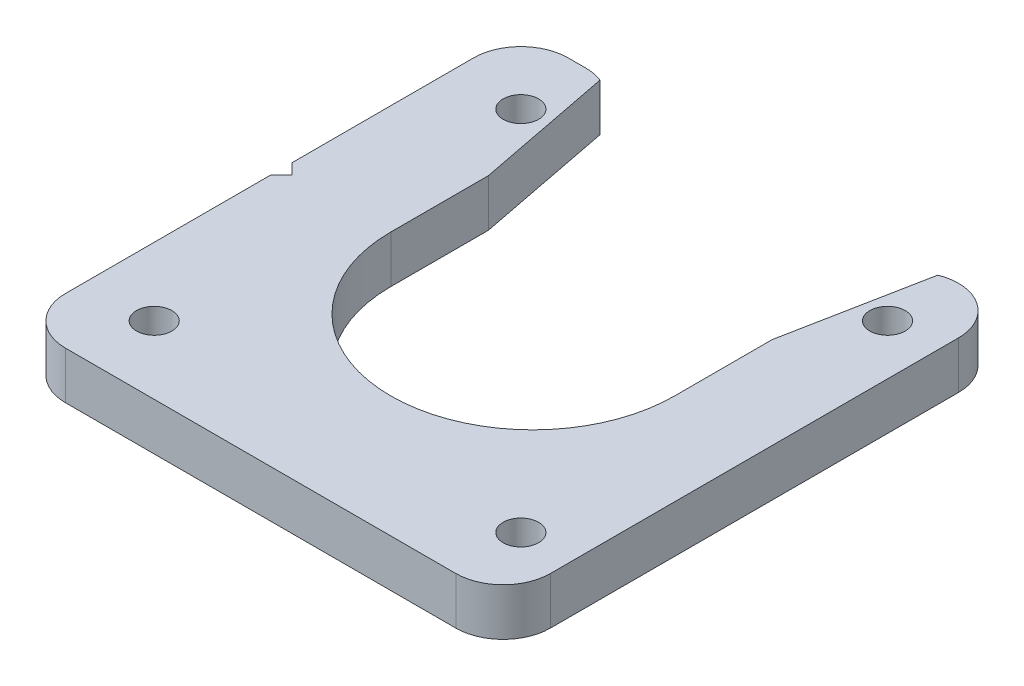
ISO-10303-21;
HEADER;
FILE_DESCRIPTION(('STEP AP214'),'2;1');
FILE_NAME('part.step','',(''),(''),'','','');
FILE_SCHEMA(('AUTOMOTIVE_DESIGN { 1 0 10303 214 1 1 1 1 }'));
ENDSEC;
DATA;
#1=APPLICATION_CONTEXT('core data for automotive mechanical design processes');
#2=APPLICATION_PROTOCOL_DEFINITION('international standard','automotive_design',2000,#1);
#3=PRODUCT_CONTEXT('',#1,'mechanical');
#4=PRODUCT('Part','Part','',(#3));
#5=PRODUCT_RELATED_PRODUCT_CATEGORY('part','',(#4));
#6=PRODUCT_DEFINITION_FORMATION('','',#4);
#7=PRODUCT_DEFINITION_CONTEXT('part definition',#1,'design');
#8=PRODUCT_DEFINITION('design','',#6,#7);
#9=PRODUCT_DEFINITION_SHAPE('','',#8);
#10=(LENGTH_UNIT() NAMED_UNIT(*) SI_UNIT(.MILLI.,.METRE.));
#11=(NAMED_UNIT(*) PLANE_ANGLE_UNIT() SI_UNIT($,.RADIAN.));
#12=(NAMED_UNIT(*) SI_UNIT($,.STERADIAN.) SOLID_ANGLE_UNIT());
#13=UNCERTAINTY_MEASURE_WITH_UNIT(LENGTH_MEASURE(1.E-05),#10,'distance_accuracy_value','');
#14=(GEOMETRIC_REPRESENTATION_CONTEXT(3) GLOBAL_UNCERTAINTY_ASSIGNED_CONTEXT((#13)) GLOBAL_UNIT_ASSIGNED_CONTEXT((#10,
#11,#12)) REPRESENTATION_CONTEXT('',''));
#15=CARTESIAN_POINT('',(0.,0.,0.));
#16=DIRECTION('',(0.,0.,1.));
#17=DIRECTION('',(1.,0.,0.));
#18=AXIS2_PLACEMENT_3D('',#15,#16,#17);
#19=CARTESIAN_POINT('',(-15.75,-2.,-20.25));
#20=DIRECTION('',(0.,0.,-1.));
#21=DIRECTION('',(-1.,0.,0.));
#22=AXIS2_PLACEMENT_3D('',#19,#20,#21);
#23=PLANE('',#22);
#24=DIRECTION('',(0.,1.,0.));
#25=VECTOR('',#24,1.);
#26=CARTESIAN_POINT('',(-15.75,-2.,-20.25));
#27=LINE('',#26,#25);
#28=CARTESIAN_POINT('',(-15.75,-2.,-20.25));
#29=VERTEX_POINT('',#28);
#30=CARTESIAN_POINT('',(-15.75,2.,-20.25));
#31=VERTEX_POINT('',#30);
#32=EDGE_CURVE('E239',#29,#31,#27,.T.);
#33=ORIENTED_EDGE('',*,*,#32,.F.);
#34=DIRECTION('',(-1.,0.,0.));
#35=VECTOR('',#34,1.);
#36=CARTESIAN_POINT('',(-15.75,-2.,-20.25));
#37=LINE('',#36,#35);
#38=CARTESIAN_POINT('',(-17.25,-2.,-20.25));
#39=VERTEX_POINT('',#38);
#40=EDGE_CURVE('E256',#29,#39,#37,.T.);
#41=ORIENTED_EDGE('',*,*,#40,.T.);
#42=DIRECTION('',(0.,1.,0.));
#43=VECTOR('',#42,1.);
#44=CARTESIAN_POINT('',(-17.25,-2.,-20.25));
#45=LINE('',#44,#43);
#46=CARTESIAN_POINT('',(-17.25,2.,-20.25));
#47=VERTEX_POINT('',#46);
#48=EDGE_CURVE('E210',#47,#39,#45,.F.);
#49=ORIENTED_EDGE('',*,*,#48,.F.);
#50=DIRECTION('',(1.,0.,0.));
#51=VECTOR('',#50,1.);
#52=CARTESIAN_POINT('',(0.,2.,-20.25));
#53=LINE('',#52,#51);
#54=EDGE_CURVE('E216',#31,#47,#53,.F.);
#55=ORIENTED_EDGE('',*,*,#54,.F.);
#56=EDGE_LOOP('',(#33,#41,#49,#55));
#57=FACE_BOUND('',#56,.T.);
#58=ADVANCED_FACE('F17',(#57),#23,.T.);
#59=CARTESIAN_POINT('',(-21.25,-2.,-0.9));
#60=DIRECTION('',(-0.707106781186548,0.,0.707106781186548));
#61=DIRECTION('',(0.707106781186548,0.,0.707106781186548));
#62=AXIS2_PLACEMENT_3D('',#59,#60,#61);
#63=PLANE('',#62);
#64=DIRECTION('',(0.,1.,0.));
#65=VECTOR('',#64,1.);
#66=CARTESIAN_POINT('',(-21.25,-2.,-0.9));
#67=LINE('',#66,#65);
#68=CARTESIAN_POINT('',(-21.25,-2.,-0.9));
#69=VERTEX_POINT('',#68);
#70=CARTESIAN_POINT('',(-21.25,2.,-0.9));
#71=VERTEX_POINT('',#70);
#72=EDGE_CURVE('E208',#69,#71,#67,.T.);
#73=ORIENTED_EDGE('',*,*,#72,.F.);
#74=DIRECTION('',(0.707106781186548,0.,0.707106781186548));
#75=VECTOR('',#74,1.);
#76=CARTESIAN_POINT('',(-21.25,-2.,-0.9));
#77=LINE('',#76,#75);
#78=CARTESIAN_POINT('',(-20.35,-2.,0.));
#79=VERTEX_POINT('',#78);
#80=EDGE_CURVE('E254',#69,#79,#77,.T.);
#81=ORIENTED_EDGE('',*,*,#80,.T.);
#82=DIRECTION('',(0.,1.,0.));
#83=VECTOR('',#82,1.);
#84=CARTESIAN_POINT('',(-20.35,-2.,0.));
#85=LINE('',#84,#83);
#86=CARTESIAN_POINT('',(-20.35,2.,0.));
#87=VERTEX_POINT('',#86);
#88=EDGE_CURVE('E240',#87,#79,#85,.F.);
#89=ORIENTED_EDGE('',*,*,#88,.F.);
#90=DIRECTION('',(0.707106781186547,0.,0.707106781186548));
#91=VECTOR('',#90,1.);
#92=CARTESIAN_POINT('',(-21.25,2.,-0.9));
#93=LINE('',#92,#91);
#94=EDGE_CURVE('E245',#71,#87,#93,.T.);
#95=ORIENTED_EDGE('',*,*,#94,.F.);
#96=EDGE_LOOP('',(#73,#81,#89,#95));
#97=FACE_BOUND('',#96,.T.);
#98=ADVANCED_FACE('F404',(#97),#63,.T.);
#99=CARTESIAN_POINT('',(-20.35,-2.,0.));
#100=DIRECTION('',(-0.707106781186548,0.,-0.707106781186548));
#101=DIRECTION('',(-0.707106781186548,0.,0.707106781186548));
#102=AXIS2_PLACEMENT_3D('',#99,#100,#101);
#103=PLANE('',#102);
#104=ORIENTED_EDGE('',*,*,#88,.T.);
#105=DIRECTION('',(-0.707106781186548,0.,0.707106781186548));
#106=VECTOR('',#105,1.);
#107=CARTESIAN_POINT('',(-20.35,-2.,0.));
#108=LINE('',#107,#106);
#109=CARTESIAN_POINT('',(-21.25,-2.,0.9));
#110=VERTEX_POINT('',#109);
#111=EDGE_CURVE('E237',#79,#110,#108,.T.);
#112=ORIENTED_EDGE('',*,*,#111,.T.);
#113=DIRECTION('',(0.,1.,0.));
#114=VECTOR('',#113,1.);
#115=CARTESIAN_POINT('',(-21.25,-2.,0.9));
#116=LINE('',#115,#114);
#117=CARTESIAN_POINT('',(-21.25,2.,0.9));
#118=VERTEX_POINT('',#117);
#119=EDGE_CURVE('E199',#118,#110,#116,.F.);
#120=ORIENTED_EDGE('',*,*,#119,.F.);
#121=DIRECTION('',(-0.707106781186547,0.,0.707106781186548));
#122=VECTOR('',#121,1.);
#123=CARTESIAN_POINT('',(-20.35,2.,0.));
#124=LINE('',#123,#122);
#125=EDGE_CURVE('E243',#87,#118,#124,.T.);
#126=ORIENTED_EDGE('',*,*,#125,.F.);
#127=EDGE_LOOP('',(#104,#112,#120,#126));
#128=FACE_BOUND('',#127,.T.);
#129=ADVANCED_FACE('F400',(#128),#103,.T.);
#130=CARTESIAN_POINT('',(-15.75,-2.,-16.25));
#131=DIRECTION('',(0.,1.,0.));
#132=DIRECTION('',(0.,0.,1.));
#133=AXIS2_PLACEMENT_3D('',#130,#131,#132);
#134=CYLINDRICAL_SURFACE('',#133,4.);
#135=DIRECTION('',(0.,1.,0.));
#136=VECTOR('',#135,1.);
#137=CARTESIAN_POINT('',(-14.2780019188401,-2.,-19.96930391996));
#138=LINE('',#137,#136);
#139=CARTESIAN_POINT('',(-14.2780019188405,-2.,-19.9693039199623));
#140=VERTEX_POINT('',#139);
#141=CARTESIAN_POINT('',(-14.2780019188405,2.,-19.9693039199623));
#142=VERTEX_POINT('',#141);
#143=EDGE_CURVE('E142',#140,#142,#138,.T.);
#144=ORIENTED_EDGE('',*,*,#143,.F.);
#145=CARTESIAN_POINT('',(-15.75,-2.,-16.25));
#146=DIRECTION('',(0.,1.,0.));
#147=DIRECTION('',(0.,0.,1.));
#148=AXIS2_PLACEMENT_3D('',#145,#146,#147);
#149=CIRCLE('',#148,4.);
#150=EDGE_CURVE('E20',#140,#29,#149,.T.);
#151=ORIENTED_EDGE('',*,*,#150,.T.);
#152=ORIENTED_EDGE('',*,*,#32,.T.);
#153=CARTESIAN_POINT('',(-15.75,2.,-16.25));
#154=DIRECTION('',(0.,1.,0.));
#155=DIRECTION('',(0.,0.,1.));
#156=AXIS2_PLACEMENT_3D('',#153,#154,#155);
#157=CIRCLE('',#156,4.);
#158=EDGE_CURVE('E217',#142,#31,#157,.T.);
#159=ORIENTED_EDGE('',*,*,#158,.F.);
#160=EDGE_LOOP('',(#144,#151,#152,#159));
#161=FACE_BOUND('',#160,.T.);
#162=ADVANCED_FACE('F537',(#161),#134,.T.);
#163=CARTESIAN_POINT('',(0.,2.,0.));
#164=DIRECTION('',(0.,1.,0.));
#165=DIRECTION('',(0.,0.,1.));
#166=AXIS2_PLACEMENT_3D('',#163,#164,#165);
#167=PLANE('',#166);
#168=CARTESIAN_POINT('',(-15.5,2.,-14.5));
#169=DIRECTION('',(0.,1.,0.));
#170=DIRECTION('',(0.,0.,1.));
#171=AXIS2_PLACEMENT_3D('',#168,#169,#170);
#172=CIRCLE('',#171,1.5);
#173=CARTESIAN_POINT('',(-15.5,2.,-13.));
#174=VERTEX_POINT('',#173);
#175=EDGE_CURVE('E298',#174,#174,#172,.F.);
#176=ORIENTED_EDGE('',*,*,#175,.T.);
#177=EDGE_LOOP('',(#176));
#178=FACE_BOUND('',#177,.T.);
#179=CARTESIAN_POINT('',(-15.5,2.,16.5));
#180=DIRECTION('',(0.,1.,0.));
#181=DIRECTION('',(0.,0.,1.));
#182=AXIS2_PLACEMENT_3D('',#179,#180,#181);
#183=CIRCLE('',#182,1.5);
#184=CARTESIAN_POINT('',(-15.5,2.,18.));
#185=VERTEX_POINT('',#184);
#186=EDGE_CURVE('E301',#185,#185,#183,.F.);
#187=ORIENTED_EDGE('',*,*,#186,.T.);
#188=EDGE_LOOP('',(#187));
#189=FACE_BOUND('',#188,.T.);
#190=CARTESIAN_POINT('',(15.5,2.,16.5));
#191=DIRECTION('',(0.,1.,0.));
#192=DIRECTION('',(0.,0.,1.));
#193=AXIS2_PLACEMENT_3D('',#190,#191,#192);
#194=CIRCLE('',#193,1.5);
#195=CARTESIAN_POINT('',(15.5,2.,18.));
#196=VERTEX_POINT('',#195);
#197=EDGE_CURVE('E163',#196,#196,#194,.F.);
#198=ORIENTED_EDGE('',*,*,#197,.T.);
#199=EDGE_LOOP('',(#198));
#200=FACE_BOUND('',#199,.T.);
#201=CARTESIAN_POINT('',(15.5,2.,-14.5));
#202=DIRECTION('',(0.,1.,0.));
#203=DIRECTION('',(0.,0.,1.));
#204=AXIS2_PLACEMENT_3D('',#201,#202,#203);
#205=CIRCLE('',#204,1.5);
#206=CARTESIAN_POINT('',(15.5,2.,-13.));
#207=VERTEX_POINT('',#206);
#208=EDGE_CURVE('E160',#207,#207,#205,.F.);
#209=ORIENTED_EDGE('',*,*,#208,.T.);
#210=EDGE_LOOP('',(#209));
#211=FACE_BOUND('',#210,.T.);
#212=ORIENTED_EDGE('',*,*,#54,.T.);
#213=CARTESIAN_POINT('',(-17.25,2.,-16.25));
#214=DIRECTION('',(0.,1.,0.));
#215=DIRECTION('',(0.,0.,1.));
#216=AXIS2_PLACEMENT_3D('',#213,#214,#215);
#217=CIRCLE('',#216,4.);
#218=CARTESIAN_POINT('',(-21.25,2.,-16.25));
#219=VERTEX_POINT('',#218);
#220=EDGE_CURVE('E215',#219,#47,#217,.F.);
#221=ORIENTED_EDGE('',*,*,#220,.F.);
#222=DIRECTION('',(0.,0.,1.));
#223=VECTOR('',#222,1.);
#224=CARTESIAN_POINT('',(-21.25,2.,-16.25));
#225=LINE('',#224,#223);
#226=EDGE_CURVE('E207',#71,#219,#225,.F.);
#227=ORIENTED_EDGE('',*,*,#226,.F.);
#228=ORIENTED_EDGE('',*,*,#94,.T.);
#229=ORIENTED_EDGE('',*,*,#125,.T.);
#230=DIRECTION('',(0.,0.,1.));
#231=VECTOR('',#230,1.);
#232=CARTESIAN_POINT('',(-21.25,2.,0.9));
#233=LINE('',#232,#231);
#234=CARTESIAN_POINT('',(-21.25,2.,18.25));
#235=VERTEX_POINT('',#234);
#236=EDGE_CURVE('E202',#235,#118,#233,.F.);
#237=ORIENTED_EDGE('',*,*,#236,.F.);
#238=CARTESIAN_POINT('',(-17.25,2.,18.25));
#239=DIRECTION('',(0.,1.,0.));
#240=DIRECTION('',(0.,0.,1.));
#241=AXIS2_PLACEMENT_3D('',#238,#239,#240);
#242=CIRCLE('',#241,4.);
#243=CARTESIAN_POINT('',(-17.25,2.,22.25));
#244=VERTEX_POINT('',#243);
#245=EDGE_CURVE('E198',#244,#235,#242,.F.);
#246=ORIENTED_EDGE('',*,*,#245,.F.);
#247=DIRECTION('',(1.,0.,0.));
#248=VECTOR('',#247,1.);
#249=CARTESIAN_POINT('',(-17.25,2.,22.25));
#250=LINE('',#249,#248);
#251=CARTESIAN_POINT('',(15.75,2.,22.25));
#252=VERTEX_POINT('',#251);
#253=EDGE_CURVE('E195',#252,#244,#250,.F.);
#254=ORIENTED_EDGE('',*,*,#253,.F.);
#255=CARTESIAN_POINT('',(15.75,2.,18.25));
#256=DIRECTION('',(0.,1.,0.));
#257=DIRECTION('',(0.,0.,1.));
#258=AXIS2_PLACEMENT_3D('',#255,#256,#257);
#259=CIRCLE('',#258,4.);
#260=CARTESIAN_POINT('',(19.75,2.,18.25));
#261=VERTEX_POINT('',#260);
#262=EDGE_CURVE('E192',#261,#252,#259,.F.);
#263=ORIENTED_EDGE('',*,*,#262,.F.);
#264=DIRECTION('',(0.,0.,-1.));
#265=VECTOR('',#264,1.);
#266=CARTESIAN_POINT('',(19.75,2.,18.25));
#267=LINE('',#266,#265);
#268=CARTESIAN_POINT('',(19.75,2.,-16.25));
#269=VERTEX_POINT('',#268);
#270=EDGE_CURVE('E188',#269,#261,#267,.F.);
#271=ORIENTED_EDGE('',*,*,#270,.F.);
#272=CARTESIAN_POINT('',(15.75,2.,-16.25));
#273=DIRECTION('',(0.,1.,0.));
#274=DIRECTION('',(0.,0.,1.));
#275=AXIS2_PLACEMENT_3D('',#272,#273,#274);
#276=CIRCLE('',#275,4.);
#277=CARTESIAN_POINT('',(14.2780019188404,2.,-19.9693039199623));
#278=VERTEX_POINT('',#277);
#279=EDGE_CURVE('E184',#278,#269,#276,.F.);
#280=ORIENTED_EDGE('',*,*,#279,.F.);
#281=DIRECTION('',(-0.190808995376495,0.,0.981627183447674));
#282=VECTOR('',#281,1.);
#283=CARTESIAN_POINT('',(14.27800191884,2.,-19.96930391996));
#284=LINE('',#283,#282);
#285=CARTESIAN_POINT('',(12.,2.,-8.25000000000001));
#286=VERTEX_POINT('',#285);
#287=EDGE_CURVE('E181',#286,#278,#284,.F.);
#288=ORIENTED_EDGE('',*,*,#287,.F.);
#289=DIRECTION('',(0.,0.,1.));
#290=VECTOR('',#289,1.);
#291=CARTESIAN_POINT('',(12.,2.,-8.25));
#292=LINE('',#291,#290);
#293=CARTESIAN_POINT('',(12.,2.,0.));
#294=VERTEX_POINT('',#293);
#295=EDGE_CURVE('E176',#294,#286,#292,.F.);
#296=ORIENTED_EDGE('',*,*,#295,.F.);
#297=CARTESIAN_POINT('',(0.,2.,0.));
#298=DIRECTION('',(0.,1.,0.));
#299=DIRECTION('',(0.,0.,1.));
#300=AXIS2_PLACEMENT_3D('',#297,#298,#299);
#301=CIRCLE('',#300,12.);
#302=CARTESIAN_POINT('',(-12.,2.,0.));
#303=VERTEX_POINT('',#302);
#304=EDGE_CURVE('E151',#294,#303,#301,.F.);
#305=ORIENTED_EDGE('',*,*,#304,.T.);
#306=DIRECTION('',(0.,0.,-1.));
#307=VECTOR('',#306,1.);
#308=CARTESIAN_POINT('',(-12.,2.,0.));
#309=LINE('',#308,#307);
#310=CARTESIAN_POINT('',(-12.,2.,-8.25));
#311=VERTEX_POINT('',#310);
#312=EDGE_CURVE('E148',#311,#303,#309,.F.);
#313=ORIENTED_EDGE('',*,*,#312,.F.);
#314=DIRECTION('',(-0.190808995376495,0.,-0.981627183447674));
#315=VECTOR('',#314,1.);
#316=CARTESIAN_POINT('',(-12.,2.,-8.25));
#317=LINE('',#316,#315);
#318=EDGE_CURVE('E136',#142,#311,#317,.F.);
#319=ORIENTED_EDGE('',*,*,#318,.F.);
#320=ORIENTED_EDGE('',*,*,#158,.T.);
#321=EDGE_LOOP('',(#212,#221,#227,#228,#229,#237,#246,#254,#263,#271,#280,#288,#296,#305,#313,
#319,#320));
#322=FACE_BOUND('',#321,.T.);
#323=ADVANCED_FACE('F149',(#178,#189,#200,#211,#322),#167,.T.);
#324=CARTESIAN_POINT('',(-17.25,-2.,-16.25));
#325=DIRECTION('',(0.,1.,0.));
#326=DIRECTION('',(0.,0.,1.));
#327=AXIS2_PLACEMENT_3D('',#324,#325,#326);
#328=CYLINDRICAL_SURFACE('',#327,4.);
#329=ORIENTED_EDGE('',*,*,#48,.T.);
#330=CARTESIAN_POINT('',(-17.25,-2.,-16.25));
#331=DIRECTION('',(0.,1.,0.));
#332=DIRECTION('',(0.,0.,1.));
#333=AXIS2_PLACEMENT_3D('',#330,#331,#332);
#334=CIRCLE('',#333,4.);
#335=CARTESIAN_POINT('',(-21.25,-2.,-16.25));
#336=VERTEX_POINT('',#335);
#337=EDGE_CURVE('E294',#39,#336,#334,.T.);
#338=ORIENTED_EDGE('',*,*,#337,.T.);
#339=DIRECTION('',(0.,1.,0.));
#340=VECTOR('',#339,1.);
#341=CARTESIAN_POINT('',(-21.25,-2.,-16.25));
#342=LINE('',#341,#340);
#343=EDGE_CURVE('E205',#219,#336,#342,.F.);
#344=ORIENTED_EDGE('',*,*,#343,.F.);
#345=ORIENTED_EDGE('',*,*,#220,.T.);
#346=EDGE_LOOP('',(#329,#338,#344,#345));
#347=FACE_BOUND('',#346,.T.);
#348=ADVANCED_FACE('F322',(#347),#328,.T.);
#349=CARTESIAN_POINT('',(-21.25,-2.,-16.25));
#350=DIRECTION('',(-1.,0.,0.));
#351=DIRECTION('',(0.,0.,1.));
#352=AXIS2_PLACEMENT_3D('',#349,#350,#351);
#353=PLANE('',#352);
#354=ORIENTED_EDGE('',*,*,#343,.T.);
#355=DIRECTION('',(0.,0.,1.));
#356=VECTOR('',#355,1.);
#357=CARTESIAN_POINT('',(-21.25,-2.,0.));
#358=LINE('',#357,#356);
#359=EDGE_CURVE('E297',#336,#69,#358,.T.);
#360=ORIENTED_EDGE('',*,*,#359,.T.);
#361=ORIENTED_EDGE('',*,*,#72,.T.);
#362=ORIENTED_EDGE('',*,*,#226,.T.);
#363=EDGE_LOOP('',(#354,#360,#361,#362));
#364=FACE_BOUND('',#363,.T.);
#365=ADVANCED_FACE('F406',(#364),#353,.T.);
#366=CARTESIAN_POINT('',(-21.25,-2.,0.9));
#367=DIRECTION('',(-1.,0.,0.));
#368=DIRECTION('',(0.,0.,1.));
#369=AXIS2_PLACEMENT_3D('',#366,#367,#368);
#370=PLANE('',#369);
#371=ORIENTED_EDGE('',*,*,#119,.T.);
#372=DIRECTION('',(0.,0.,1.));
#373=VECTOR('',#372,1.);
#374=CARTESIAN_POINT('',(-21.25,-2.,0.));
#375=LINE('',#374,#373);
#376=CARTESIAN_POINT('',(-21.25,-2.,18.25));
#377=VERTEX_POINT('',#376);
#378=EDGE_CURVE('E293',#110,#377,#375,.T.);
#379=ORIENTED_EDGE('',*,*,#378,.T.);
#380=DIRECTION('',(0.,1.,0.));
#381=VECTOR('',#380,1.);
#382=CARTESIAN_POINT('',(-21.25,-2.,18.25));
#383=LINE('',#382,#381);
#384=EDGE_CURVE('E196',#235,#377,#383,.F.);
#385=ORIENTED_EDGE('',*,*,#384,.F.);
#386=ORIENTED_EDGE('',*,*,#236,.T.);
#387=EDGE_LOOP('',(#371,#379,#385,#386));
#388=FACE_BOUND('',#387,.T.);
#389=ADVANCED_FACE('F396',(#388),#370,.T.);
#390=CARTESIAN_POINT('',(-17.25,-2.,18.25));
#391=DIRECTION('',(0.,1.,0.));
#392=DIRECTION('',(0.,0.,1.));
#393=AXIS2_PLACEMENT_3D('',#390,#391,#392);
#394=CYLINDRICAL_SURFACE('',#393,4.);
#395=ORIENTED_EDGE('',*,*,#384,.T.);
#396=CARTESIAN_POINT('',(-17.25,-2.,18.25));
#397=DIRECTION('',(0.,1.,0.));
#398=DIRECTION('',(0.,0.,1.));
#399=AXIS2_PLACEMENT_3D('',#396,#397,#398);
#400=CIRCLE('',#399,4.);
#401=CARTESIAN_POINT('',(-17.25,-2.,22.25));
#402=VERTEX_POINT('',#401);
#403=EDGE_CURVE('E290',#377,#402,#400,.T.);
#404=ORIENTED_EDGE('',*,*,#403,.T.);
#405=DIRECTION('',(0.,1.,0.));
#406=VECTOR('',#405,1.);
#407=CARTESIAN_POINT('',(-17.25,-2.,22.25));
#408=LINE('',#407,#406);
#409=EDGE_CURVE('E193',#244,#402,#408,.F.);
#410=ORIENTED_EDGE('',*,*,#409,.F.);
#411=ORIENTED_EDGE('',*,*,#245,.T.);
#412=EDGE_LOOP('',(#395,#404,#410,#411));
#413=FACE_BOUND('',#412,.T.);
#414=ADVANCED_FACE('F391',(#413),#394,.T.);
#415=CARTESIAN_POINT('',(-17.25,-2.,22.25));
#416=DIRECTION('',(0.,0.,1.));
#417=DIRECTION('',(1.,0.,0.));
#418=AXIS2_PLACEMENT_3D('',#415,#416,#417);
#419=PLANE('',#418);
#420=ORIENTED_EDGE('',*,*,#409,.T.);
#421=DIRECTION('',(1.,0.,0.));
#422=VECTOR('',#421,1.);
#423=CARTESIAN_POINT('',(0.,-2.,22.25));
#424=LINE('',#423,#422);
#425=CARTESIAN_POINT('',(15.75,-2.,22.25));
#426=VERTEX_POINT('',#425);
#427=EDGE_CURVE('E289',#402,#426,#424,.T.);
#428=ORIENTED_EDGE('',*,*,#427,.T.);
#429=DIRECTION('',(0.,1.,0.));
#430=VECTOR('',#429,1.);
#431=CARTESIAN_POINT('',(15.75,-2.,22.25));
#432=LINE('',#431,#430);
#433=EDGE_CURVE('E189',#252,#426,#432,.F.);
#434=ORIENTED_EDGE('',*,*,#433,.F.);
#435=ORIENTED_EDGE('',*,*,#253,.T.);
#436=EDGE_LOOP('',(#420,#428,#434,#435));
#437=FACE_BOUND('',#436,.T.);
#438=ADVANCED_FACE('F387',(#437),#419,.T.);
#439=CARTESIAN_POINT('',(15.75,-2.,18.25));
#440=DIRECTION('',(0.,1.,0.));
#441=DIRECTION('',(0.,0.,1.));
#442=AXIS2_PLACEMENT_3D('',#439,#440,#441);
#443=CYLINDRICAL_SURFACE('',#442,4.);
#444=ORIENTED_EDGE('',*,*,#433,.T.);
#445=CARTESIAN_POINT('',(15.75,-2.,18.25));
#446=DIRECTION('',(0.,1.,0.));
#447=DIRECTION('',(0.,0.,1.));
#448=AXIS2_PLACEMENT_3D('',#445,#446,#447);
#449=CIRCLE('',#448,4.);
#450=CARTESIAN_POINT('',(19.75,-2.,18.25));
#451=VERTEX_POINT('',#450);
#452=EDGE_CURVE('E285',#426,#451,#449,.T.);
#453=ORIENTED_EDGE('',*,*,#452,.T.);
#454=DIRECTION('',(0.,1.,0.));
#455=VECTOR('',#454,1.);
#456=CARTESIAN_POINT('',(19.75,-2.,18.25));
#457=LINE('',#456,#455);
#458=EDGE_CURVE('E185',#261,#451,#457,.F.);
#459=ORIENTED_EDGE('',*,*,#458,.F.);
#460=ORIENTED_EDGE('',*,*,#262,.T.);
#461=EDGE_LOOP('',(#444,#453,#459,#460));
#462=FACE_BOUND('',#461,.T.);
#463=ADVANCED_FACE('F381',(#462),#443,.T.);
#464=CARTESIAN_POINT('',(19.75,-2.,18.25));
#465=DIRECTION('',(1.,0.,0.));
#466=DIRECTION('',(0.,0.,-1.));
#467=AXIS2_PLACEMENT_3D('',#464,#465,#466);
#468=PLANE('',#467);
#469=ORIENTED_EDGE('',*,*,#458,.T.);
#470=DIRECTION('',(0.,0.,1.));
#471=VECTOR('',#470,1.);
#472=CARTESIAN_POINT('',(19.75,-2.,0.));
#473=LINE('',#472,#471);
#474=CARTESIAN_POINT('',(19.75,-2.,-16.25));
#475=VERTEX_POINT('',#474);
#476=EDGE_CURVE('E284',#451,#475,#473,.F.);
#477=ORIENTED_EDGE('',*,*,#476,.T.);
#478=DIRECTION('',(0.,1.,0.));
#479=VECTOR('',#478,1.);
#480=CARTESIAN_POINT('',(19.75,-2.,-16.25));
#481=LINE('',#480,#479);
#482=EDGE_CURVE('E182',#269,#475,#481,.F.);
#483=ORIENTED_EDGE('',*,*,#482,.F.);
#484=ORIENTED_EDGE('',*,*,#270,.T.);
#485=EDGE_LOOP('',(#469,#477,#483,#484));
#486=FACE_BOUND('',#485,.T.);
#487=ADVANCED_FACE('F377',(#486),#468,.T.);
#488=CARTESIAN_POINT('',(15.75,-2.,-16.25));
#489=DIRECTION('',(0.,1.,0.));
#490=DIRECTION('',(0.,0.,1.));
#491=AXIS2_PLACEMENT_3D('',#488,#489,#490);
#492=CYLINDRICAL_SURFACE('',#491,4.);
#493=ORIENTED_EDGE('',*,*,#482,.T.);
#494=CARTESIAN_POINT('',(15.75,-2.,-16.25));
#495=DIRECTION('',(0.,1.,0.));
#496=DIRECTION('',(0.,0.,1.));
#497=AXIS2_PLACEMENT_3D('',#494,#495,#496);
#498=CIRCLE('',#497,4.);
#499=CARTESIAN_POINT('',(14.2780019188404,-2.,-19.9693039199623));
#500=VERTEX_POINT('',#499);
#501=EDGE_CURVE('E280',#475,#500,#498,.T.);
#502=ORIENTED_EDGE('',*,*,#501,.T.);
#503=DIRECTION('',(0.,1.,0.));
#504=VECTOR('',#503,1.);
#505=CARTESIAN_POINT('',(14.27800191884,-2.,-19.96930391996));
#506=LINE('',#505,#504);
#507=EDGE_CURVE('E179',#278,#500,#506,.F.);
#508=ORIENTED_EDGE('',*,*,#507,.F.);
#509=ORIENTED_EDGE('',*,*,#279,.T.);
#510=EDGE_LOOP('',(#493,#502,#508,#509));
#511=FACE_BOUND('',#510,.T.);
#512=ADVANCED_FACE('F371',(#511),#492,.T.);
#513=CARTESIAN_POINT('',(14.27800191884,-2.,-19.96930391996));
#514=DIRECTION('',(-0.981627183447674,0.,-0.190808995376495));
#515=DIRECTION('',(-0.190808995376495,0.,0.981627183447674));
#516=AXIS2_PLACEMENT_3D('',#513,#514,#515);
#517=PLANE('',#516);
#518=ORIENTED_EDGE('',*,*,#507,.T.);
#519=DIRECTION('',(-0.190808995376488,0.,0.981627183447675));
#520=VECTOR('',#519,1.);
#521=CARTESIAN_POINT('',(14.27800191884,-2.,-19.96930391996));
#522=LINE('',#521,#520);
#523=CARTESIAN_POINT('',(12.,-2.,-8.25000000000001));
#524=VERTEX_POINT('',#523);
#525=EDGE_CURVE('E283',#500,#524,#522,.T.);
#526=ORIENTED_EDGE('',*,*,#525,.T.);
#527=DIRECTION('',(0.,1.,0.));
#528=VECTOR('',#527,1.);
#529=CARTESIAN_POINT('',(12.,-2.,-8.25));
#530=LINE('',#529,#528);
#531=EDGE_CURVE('E174',#286,#524,#530,.F.);
#532=ORIENTED_EDGE('',*,*,#531,.F.);
#533=ORIENTED_EDGE('',*,*,#287,.T.);
#534=EDGE_LOOP('',(#518,#526,#532,#533));
#535=FACE_BOUND('',#534,.T.);
#536=ADVANCED_FACE('F367',(#535),#517,.T.);
#537=CARTESIAN_POINT('',(12.,-2.,-8.25));
#538=DIRECTION('',(-1.,0.,0.));
#539=DIRECTION('',(0.,0.,1.));
#540=AXIS2_PLACEMENT_3D('',#537,#538,#539);
#541=PLANE('',#540);
#542=ORIENTED_EDGE('',*,*,#531,.T.);
#543=DIRECTION('',(0.,0.,1.));
#544=VECTOR('',#543,1.);
#545=CARTESIAN_POINT('',(12.,-2.,0.));
#546=LINE('',#545,#544);
#547=CARTESIAN_POINT('',(12.,-2.,0.));
#548=VERTEX_POINT('',#547);
#549=EDGE_CURVE('E279',#524,#548,#546,.T.);
#550=ORIENTED_EDGE('',*,*,#549,.T.);
#551=DIRECTION('',(0.,1.,0.));
#552=VECTOR('',#551,1.);
#553=CARTESIAN_POINT('',(12.,-2.,0.));
#554=LINE('',#553,#552);
#555=EDGE_CURVE('E171',#548,#294,#554,.T.);
#556=ORIENTED_EDGE('',*,*,#555,.T.);
#557=ORIENTED_EDGE('',*,*,#295,.T.);
#558=EDGE_LOOP('',(#542,#550,#556,#557));
#559=FACE_BOUND('',#558,.T.);
#560=ADVANCED_FACE('F361',(#559),#541,.T.);
#561=CARTESIAN_POINT('',(0.,-2.,0.));
#562=DIRECTION('',(0.,1.,0.));
#563=DIRECTION('',(0.,0.,1.));
#564=AXIS2_PLACEMENT_3D('',#561,#562,#563);
#565=CYLINDRICAL_SURFACE('',#564,12.);
#566=ORIENTED_EDGE('',*,*,#304,.F.);
#567=ORIENTED_EDGE('',*,*,#555,.F.);
#568=CARTESIAN_POINT('',(0.,-2.,0.));
#569=DIRECTION('',(0.,1.,0.));
#570=DIRECTION('',(0.,0.,1.));
#571=AXIS2_PLACEMENT_3D('',#568,#569,#570);
#572=CIRCLE('',#571,12.);
#573=CARTESIAN_POINT('',(-12.,-2.,0.));
#574=VERTEX_POINT('',#573);
#575=EDGE_CURVE('E275',#548,#574,#572,.F.);
#576=ORIENTED_EDGE('',*,*,#575,.T.);
#577=DIRECTION('',(0.,1.,0.));
#578=VECTOR('',#577,1.);
#579=CARTESIAN_POINT('',(-12.,-2.,0.));
#580=LINE('',#579,#578);
#581=EDGE_CURVE('E154',#303,#574,#580,.F.);
#582=ORIENTED_EDGE('',*,*,#581,.F.);
#583=EDGE_LOOP('',(#566,#567,#576,#582));
#584=FACE_BOUND('',#583,.T.);
#585=ADVANCED_FACE('F359',(#584),#565,.F.);
#586=CARTESIAN_POINT('',(-12.,-2.,0.));
#587=DIRECTION('',(1.,0.,0.));
#588=DIRECTION('',(0.,0.,-1.));
#589=AXIS2_PLACEMENT_3D('',#586,#587,#588);
#590=PLANE('',#589);
#591=ORIENTED_EDGE('',*,*,#581,.T.);
#592=DIRECTION('',(0.,0.,1.));
#593=VECTOR('',#592,1.);
#594=CARTESIAN_POINT('',(-12.,-2.,0.));
#595=LINE('',#594,#593);
#596=CARTESIAN_POINT('',(-12.,-2.,-8.24999999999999));
#597=VERTEX_POINT('',#596);
#598=EDGE_CURVE('E159',#574,#597,#595,.F.);
#599=ORIENTED_EDGE('',*,*,#598,.T.);
#600=DIRECTION('',(0.,1.,0.));
#601=VECTOR('',#600,1.);
#602=CARTESIAN_POINT('',(-12.,-2.,-8.25));
#603=LINE('',#602,#601);
#604=EDGE_CURVE('E141',#311,#597,#603,.F.);
#605=ORIENTED_EDGE('',*,*,#604,.F.);
#606=ORIENTED_EDGE('',*,*,#312,.T.);
#607=EDGE_LOOP('',(#591,#599,#605,#606));
#608=FACE_BOUND('',#607,.T.);
#609=ADVANCED_FACE('F157',(#608),#590,.T.);
#610=CARTESIAN_POINT('',(-12.,-2.,-8.25));
#611=DIRECTION('',(0.981627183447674,0.,-0.190808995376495));
#612=DIRECTION('',(-0.190808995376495,0.,-0.981627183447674));
#613=AXIS2_PLACEMENT_3D('',#610,#611,#612);
#614=PLANE('',#613);
#615=ORIENTED_EDGE('',*,*,#604,.T.);
#616=DIRECTION('',(-0.190808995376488,0.,-0.981627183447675));
#617=VECTOR('',#616,1.);
#618=CARTESIAN_POINT('',(-12.,-2.,-8.25));
#619=LINE('',#618,#617);
#620=EDGE_CURVE('E274',#597,#140,#619,.T.);
#621=ORIENTED_EDGE('',*,*,#620,.T.);
#622=ORIENTED_EDGE('',*,*,#143,.T.);
#623=ORIENTED_EDGE('',*,*,#318,.T.);
#624=EDGE_LOOP('',(#615,#621,#622,#623));
#625=FACE_BOUND('',#624,.T.);
#626=ADVANCED_FACE('F138',(#625),#614,.T.);
#627=CARTESIAN_POINT('',(15.5,-2.,-14.5));
#628=DIRECTION('',(0.,1.,0.));
#629=DIRECTION('',(0.,0.,1.));
#630=AXIS2_PLACEMENT_3D('',#627,#628,#629);
#631=CYLINDRICAL_SURFACE('',#630,1.5);
#632=ORIENTED_EDGE('',*,*,#208,.F.);
#633=EDGE_LOOP('',(#632));
#634=FACE_BOUND('',#633,.T.);
#635=CARTESIAN_POINT('',(15.5,-2.,-14.5));
#636=DIRECTION('',(0.,1.,0.));
#637=DIRECTION('',(0.,0.,1.));
#638=AXIS2_PLACEMENT_3D('',#635,#636,#637);
#639=CIRCLE('',#638,1.5);
#640=CARTESIAN_POINT('',(15.5,-2.,-13.));
#641=VERTEX_POINT('',#640);
#642=EDGE_CURVE('E271',#641,#641,#639,.F.);
#643=ORIENTED_EDGE('',*,*,#642,.T.);
#644=EDGE_LOOP('',(#643));
#645=FACE_BOUND('',#644,.T.);
#646=ADVANCED_FACE('F435',(#634,#645),#631,.F.);
#647=CARTESIAN_POINT('',(15.5,-2.,16.5));
#648=DIRECTION('',(0.,1.,0.));
#649=DIRECTION('',(0.,0.,1.));
#650=AXIS2_PLACEMENT_3D('',#647,#648,#649);
#651=CYLINDRICAL_SURFACE('',#650,1.5);
#652=ORIENTED_EDGE('',*,*,#197,.F.);
#653=EDGE_LOOP('',(#652));
#654=FACE_BOUND('',#653,.T.);
#655=CARTESIAN_POINT('',(15.5,-2.,16.5));
#656=DIRECTION('',(0.,1.,0.));
#657=DIRECTION('',(0.,0.,1.));
#658=AXIS2_PLACEMENT_3D('',#655,#656,#657);
#659=CIRCLE('',#658,1.5);
#660=CARTESIAN_POINT('',(15.5,-2.,18.));
#661=VERTEX_POINT('',#660);
#662=EDGE_CURVE('E267',#661,#661,#659,.F.);
#663=ORIENTED_EDGE('',*,*,#662,.T.);
#664=EDGE_LOOP('',(#663));
#665=FACE_BOUND('',#664,.T.);
#666=ADVANCED_FACE('F431',(#654,#665),#651,.F.);
#667=CARTESIAN_POINT('',(-15.5,-2.,16.5));
#668=DIRECTION('',(0.,1.,0.));
#669=DIRECTION('',(0.,0.,1.));
#670=AXIS2_PLACEMENT_3D('',#667,#668,#669);
#671=CYLINDRICAL_SURFACE('',#670,1.5);
#672=ORIENTED_EDGE('',*,*,#186,.F.);
#673=EDGE_LOOP('',(#672));
#674=FACE_BOUND('',#673,.T.);
#675=CARTESIAN_POINT('',(-15.5,-2.,16.5));
#676=DIRECTION('',(0.,1.,0.));
#677=DIRECTION('',(0.,0.,1.));
#678=AXIS2_PLACEMENT_3D('',#675,#676,#677);
#679=CIRCLE('',#678,1.5);
#680=CARTESIAN_POINT('',(-15.5,-2.,18.));
#681=VERTEX_POINT('',#680);
#682=EDGE_CURVE('E26',#681,#681,#679,.F.);
#683=ORIENTED_EDGE('',*,*,#682,.T.);
#684=EDGE_LOOP('',(#683));
#685=FACE_BOUND('',#684,.T.);
#686=ADVANCED_FACE('F423',(#674,#685),#671,.F.);
#687=CARTESIAN_POINT('',(-15.5,-2.,-14.5));
#688=DIRECTION('',(0.,1.,0.));
#689=DIRECTION('',(0.,0.,1.));
#690=AXIS2_PLACEMENT_3D('',#687,#688,#689);
#691=CYLINDRICAL_SURFACE('',#690,1.5);
#692=ORIENTED_EDGE('',*,*,#175,.F.);
#693=EDGE_LOOP('',(#692));
#694=FACE_BOUND('',#693,.T.);
#695=CARTESIAN_POINT('',(-15.5,-2.,-14.5));
#696=DIRECTION('',(0.,1.,0.));
#697=DIRECTION('',(0.,0.,1.));
#698=AXIS2_PLACEMENT_3D('',#695,#696,#697);
#699=CIRCLE('',#698,1.5);
#700=CARTESIAN_POINT('',(-15.5,-2.,-13.));
#701=VERTEX_POINT('',#700);
#702=EDGE_CURVE('E11',#701,#701,#699,.F.);
#703=ORIENTED_EDGE('',*,*,#702,.T.);
#704=EDGE_LOOP('',(#703));
#705=FACE_BOUND('',#704,.T.);
#706=ADVANCED_FACE('F417',(#694,#705),#691,.F.);
#707=CARTESIAN_POINT('',(0.,-2.,0.));
#708=DIRECTION('',(0.,1.,0.));
#709=DIRECTION('',(0.,0.,1.));
#710=AXIS2_PLACEMENT_3D('',#707,#708,#709);
#711=PLANE('',#710);
#712=ORIENTED_EDGE('',*,*,#702,.F.);
#713=EDGE_LOOP('',(#712));
#714=FACE_BOUND('',#713,.T.);
#715=ORIENTED_EDGE('',*,*,#682,.F.);
#716=EDGE_LOOP('',(#715));
#717=FACE_BOUND('',#716,.T.);
#718=ORIENTED_EDGE('',*,*,#662,.F.);
#719=EDGE_LOOP('',(#718));
#720=FACE_BOUND('',#719,.T.);
#721=ORIENTED_EDGE('',*,*,#642,.F.);
#722=EDGE_LOOP('',(#721));
#723=FACE_BOUND('',#722,.T.);
#724=ORIENTED_EDGE('',*,*,#150,.F.);
#725=ORIENTED_EDGE('',*,*,#620,.F.);
#726=ORIENTED_EDGE('',*,*,#598,.F.);
#727=ORIENTED_EDGE('',*,*,#575,.F.);
#728=ORIENTED_EDGE('',*,*,#549,.F.);
#729=ORIENTED_EDGE('',*,*,#525,.F.);
#730=ORIENTED_EDGE('',*,*,#501,.F.);
#731=ORIENTED_EDGE('',*,*,#476,.F.);
#732=ORIENTED_EDGE('',*,*,#452,.F.);
#733=ORIENTED_EDGE('',*,*,#427,.F.);
#734=ORIENTED_EDGE('',*,*,#403,.F.);
#735=ORIENTED_EDGE('',*,*,#378,.F.);
#736=ORIENTED_EDGE('',*,*,#111,.F.);
#737=ORIENTED_EDGE('',*,*,#80,.F.);
#738=ORIENTED_EDGE('',*,*,#359,.F.);
#739=ORIENTED_EDGE('',*,*,#337,.F.);
#740=ORIENTED_EDGE('',*,*,#40,.F.);
#741=EDGE_LOOP('',(#724,#725,#726,#727,#728,#729,#730,#731,#732,#733,#734,#735,#736,#737,#738,
#739,#740));
#742=FACE_BOUND('',#741,.T.);
#743=ADVANCED_FACE('F325',(#714,#717,#720,#723,#742),#711,.F.);
#744=CLOSED_SHELL('',(#58,#98,#129,#162,#323,#348,#365,#389,#414,#438,#463,#487,#512,#536,#560,
#585,#609,#626,#646,#666,#686,#706,#743));
#745=MANIFOLD_SOLID_BREP('B1',#744);
#746=ADVANCED_BREP_SHAPE_REPRESENTATION('',(#18,#745),#14);
#747=SHAPE_DEFINITION_REPRESENTATION(#9,#746);
ENDSEC;
END-ISO-10303-21;
